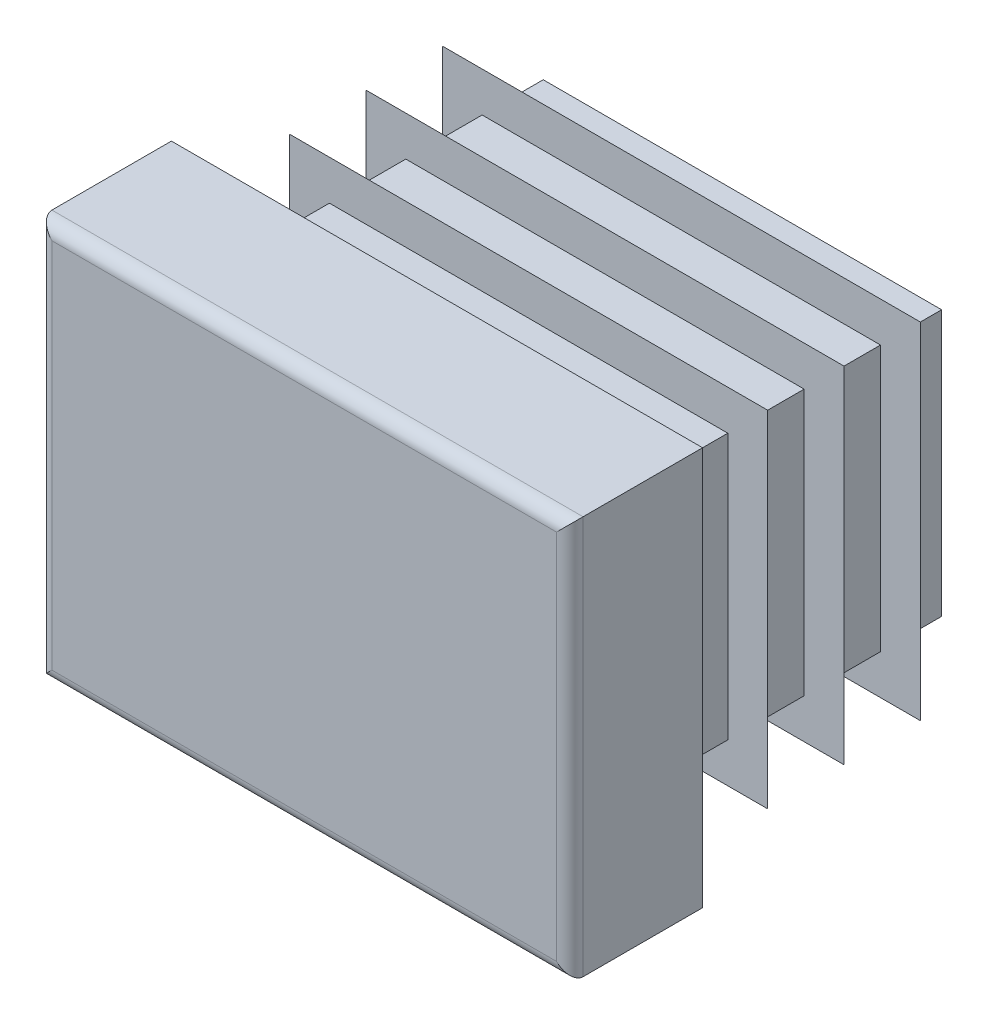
ISO-10303-21;
HEADER;
FILE_DESCRIPTION(('STEP AP214'),'2;1');
FILE_NAME('part.step','',(''),(''),'','','');
FILE_SCHEMA(('AUTOMOTIVE_DESIGN { 1 0 10303 214 1 1 1 1 }'));
ENDSEC;
DATA;
#1=APPLICATION_CONTEXT('core data for automotive mechanical design processes');
#2=APPLICATION_PROTOCOL_DEFINITION('international standard','automotive_design',2000,#1);
#3=PRODUCT_CONTEXT('',#1,'mechanical');
#4=PRODUCT('Part','Part','',(#3));
#5=PRODUCT_RELATED_PRODUCT_CATEGORY('part','',(#4));
#6=PRODUCT_DEFINITION_FORMATION('','',#4);
#7=PRODUCT_DEFINITION_CONTEXT('part definition',#1,'design');
#8=PRODUCT_DEFINITION('design','',#6,#7);
#9=PRODUCT_DEFINITION_SHAPE('','',#8);
#10=(LENGTH_UNIT() NAMED_UNIT(*) SI_UNIT(.MILLI.,.METRE.));
#11=(NAMED_UNIT(*) PLANE_ANGLE_UNIT() SI_UNIT($,.RADIAN.));
#12=(NAMED_UNIT(*) SI_UNIT($,.STERADIAN.) SOLID_ANGLE_UNIT());
#13=UNCERTAINTY_MEASURE_WITH_UNIT(LENGTH_MEASURE(1.E-05),#10,'distance_accuracy_value','');
#14=(GEOMETRIC_REPRESENTATION_CONTEXT(3) GLOBAL_UNCERTAINTY_ASSIGNED_CONTEXT((#13)) GLOBAL_UNIT_ASSIGNED_CONTEXT((#10,
#11,#12)) REPRESENTATION_CONTEXT('',''));
#15=CARTESIAN_POINT('',(0.,0.,0.));
#16=DIRECTION('',(0.,0.,1.));
#17=DIRECTION('',(1.,0.,0.));
#18=AXIS2_PLACEMENT_3D('',#15,#16,#17);
#19=CARTESIAN_POINT('',(9.5,-7.5,5.));
#20=DIRECTION('',(0.,0.,-1.));
#21=DIRECTION('',(0.,1.,0.));
#22=AXIS2_PLACEMENT_3D('',#19,#20,#21);
#23=PLANE('',#22);
#24=DIRECTION('',(0.,1.,0.));
#25=VECTOR('',#24,1.);
#26=CARTESIAN_POINT('',(-9.5,-7.5,5.));
#27=LINE('',#26,#25);
#28=CARTESIAN_POINT('',(-9.5,-7.,5.));
#29=VERTEX_POINT('',#28);
#30=CARTESIAN_POINT('',(-9.5,7.,5.));
#31=VERTEX_POINT('',#30);
#32=EDGE_CURVE('E310',#29,#31,#27,.T.);
#33=ORIENTED_EDGE('',*,*,#32,.F.);
#34=DIRECTION('',(-1.,0.,0.));
#35=VECTOR('',#34,1.);
#36=CARTESIAN_POINT('',(10.,-7.,5.));
#37=LINE('',#36,#35);
#38=CARTESIAN_POINT('',(9.5,-7.,5.));
#39=VERTEX_POINT('',#38);
#40=EDGE_CURVE('E482',#39,#29,#37,.T.);
#41=ORIENTED_EDGE('',*,*,#40,.F.);
#42=DIRECTION('',(0.,1.,0.));
#43=VECTOR('',#42,1.);
#44=CARTESIAN_POINT('',(9.5,-7.5,5.));
#45=LINE('',#44,#43);
#46=CARTESIAN_POINT('',(9.5,7.,5.));
#47=VERTEX_POINT('',#46);
#48=EDGE_CURVE('E305',#39,#47,#45,.T.);
#49=ORIENTED_EDGE('',*,*,#48,.T.);
#50=DIRECTION('',(-1.,0.,0.));
#51=VECTOR('',#50,1.);
#52=CARTESIAN_POINT('',(10.,7.,5.));
#53=LINE('',#52,#51);
#54=EDGE_CURVE('E630',#47,#31,#53,.T.);
#55=ORIENTED_EDGE('',*,*,#54,.T.);
#56=EDGE_LOOP('',(#33,#41,#49,#55));
#57=FACE_BOUND('',#56,.T.);
#58=ADVANCED_FACE('F14',(#57),#23,.F.);
#59=CARTESIAN_POINT('',(-9.5,-7.5,4.5));
#60=DIRECTION('',(0.,1.,0.));
#61=DIRECTION('',(-1.,0.,0.));
#62=AXIS2_PLACEMENT_3D('',#59,#60,#61);
#63=CYLINDRICAL_SURFACE('',#62,0.5);
#64=DIRECTION('',(0.,1.,0.));
#65=VECTOR('',#64,1.);
#66=CARTESIAN_POINT('',(-10.,-7.5,4.5));
#67=LINE('',#66,#65);
#68=CARTESIAN_POINT('',(-10.,-7.5,4.5));
#69=VERTEX_POINT('',#68);
#70=CARTESIAN_POINT('',(-10.,7.5,4.5));
#71=VERTEX_POINT('',#70);
#72=EDGE_CURVE('E402',#69,#71,#67,.T.);
#73=ORIENTED_EDGE('',*,*,#72,.F.);
#74=CARTESIAN_POINT('',(-9.5,-7.,4.5));
#75=DIRECTION('',(-0.707106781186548,0.707106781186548,0.));
#76=DIRECTION('',(0.707106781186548,0.707106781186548,0.));
#77=AXIS2_PLACEMENT_3D('',#74,#75,#76);
#78=ELLIPSE('',#77,0.707106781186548,0.5);
#79=EDGE_CURVE('E59',#69,#29,#78,.T.);
#80=ORIENTED_EDGE('',*,*,#79,.T.);
#81=ORIENTED_EDGE('',*,*,#32,.T.);
#82=CARTESIAN_POINT('',(-9.5,7.,4.5));
#83=DIRECTION('',(0.707106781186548,0.707106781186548,0.));
#84=DIRECTION('',(-0.707106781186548,0.707106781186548,0.));
#85=AXIS2_PLACEMENT_3D('',#82,#83,#84);
#86=ELLIPSE('',#85,0.707106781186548,0.5);
#87=EDGE_CURVE('E306',#31,#71,#86,.F.);
#88=ORIENTED_EDGE('',*,*,#87,.T.);
#89=EDGE_LOOP('',(#73,#80,#81,#88));
#90=FACE_BOUND('',#89,.T.);
#91=ADVANCED_FACE('F16',(#90),#63,.T.);
#92=CARTESIAN_POINT('',(-10.,-7.5,4.5));
#93=DIRECTION('',(1.,0.,0.));
#94=DIRECTION('',(0.,1.,0.));
#95=AXIS2_PLACEMENT_3D('',#92,#93,#94);
#96=PLANE('',#95);
#97=DIRECTION('',(0.,0.,-1.));
#98=VECTOR('',#97,1.);
#99=CARTESIAN_POINT('',(-10.,7.5,4.5));
#100=LINE('',#99,#98);
#101=CARTESIAN_POINT('',(-10.,7.5,0.));
#102=VERTEX_POINT('',#101);
#103=EDGE_CURVE('E615',#71,#102,#100,.T.);
#104=ORIENTED_EDGE('',*,*,#103,.T.);
#105=DIRECTION('',(0.,1.,0.));
#106=VECTOR('',#105,1.);
#107=CARTESIAN_POINT('',(-10.,-7.5,0.));
#108=LINE('',#107,#106);
#109=CARTESIAN_POINT('',(-10.,-7.5,0.));
#110=VERTEX_POINT('',#109);
#111=EDGE_CURVE('E400',#110,#102,#108,.T.);
#112=ORIENTED_EDGE('',*,*,#111,.F.);
#113=DIRECTION('',(0.,0.,-1.));
#114=VECTOR('',#113,1.);
#115=CARTESIAN_POINT('',(-10.,-7.5,4.5));
#116=LINE('',#115,#114);
#117=EDGE_CURVE('E616',#69,#110,#116,.T.);
#118=ORIENTED_EDGE('',*,*,#117,.F.);
#119=ORIENTED_EDGE('',*,*,#72,.T.);
#120=EDGE_LOOP('',(#104,#112,#118,#119));
#121=FACE_BOUND('',#120,.T.);
#122=ADVANCED_FACE('F697',(#121),#96,.F.);
#123=CARTESIAN_POINT('',(-7.5,-7.5,0.));
#124=DIRECTION('',(1.,0.,0.));
#125=DIRECTION('',(0.,1.,0.));
#126=AXIS2_PLACEMENT_3D('',#123,#124,#125);
#127=PLANE('',#126);
#128=DIRECTION('',(0.,1.,0.));
#129=VECTOR('',#128,1.);
#130=CARTESIAN_POINT('',(-7.5,-7.5,0.));
#131=LINE('',#130,#129);
#132=CARTESIAN_POINT('',(-7.5,-5.,0.));
#133=VERTEX_POINT('',#132);
#134=CARTESIAN_POINT('',(-7.5,5.,0.));
#135=VERTEX_POINT('',#134);
#136=EDGE_CURVE('E397',#133,#135,#131,.T.);
#137=ORIENTED_EDGE('',*,*,#136,.T.);
#138=DIRECTION('',(0.,0.,-1.));
#139=VECTOR('',#138,1.);
#140=CARTESIAN_POINT('',(-7.5,5.,0.));
#141=LINE('',#140,#139);
#142=CARTESIAN_POINT('',(-7.5,5.,-0.575));
#143=VERTEX_POINT('',#142);
#144=EDGE_CURVE('E495',#135,#143,#141,.T.);
#145=ORIENTED_EDGE('',*,*,#144,.T.);
#146=DIRECTION('',(0.,1.,0.));
#147=VECTOR('',#146,1.);
#148=CARTESIAN_POINT('',(-7.5,-7.5,-0.575));
#149=LINE('',#148,#147);
#150=CARTESIAN_POINT('',(-7.5,-5.,-0.575));
#151=VERTEX_POINT('',#150);
#152=EDGE_CURVE('E394',#151,#143,#149,.T.);
#153=ORIENTED_EDGE('',*,*,#152,.F.);
#154=DIRECTION('',(0.,0.,1.));
#155=VECTOR('',#154,1.);
#156=CARTESIAN_POINT('',(-7.5,-5.,0.));
#157=LINE('',#156,#155);
#158=EDGE_CURVE('E489',#151,#133,#157,.T.);
#159=ORIENTED_EDGE('',*,*,#158,.T.);
#160=EDGE_LOOP('',(#137,#145,#153,#159));
#161=FACE_BOUND('',#160,.T.);
#162=ADVANCED_FACE('F787',(#161),#127,.F.);
#163=CARTESIAN_POINT('',(-9.,-7.5,-0.575));
#164=DIRECTION('',(0.342020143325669,0.,0.939692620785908));
#165=DIRECTION('',(-0.939692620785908,0.,0.342020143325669));
#166=AXIS2_PLACEMENT_3D('',#163,#164,#165);
#167=PLANE('',#166);
#168=DIRECTION('',(0.,1.,0.));
#169=VECTOR('',#168,1.);
#170=CARTESIAN_POINT('',(-9.,-7.5,-0.575));
#171=LINE('',#170,#169);
#172=CARTESIAN_POINT('',(-9.,-6.5,-0.575));
#173=VERTEX_POINT('',#172);
#174=CARTESIAN_POINT('',(-9.,6.5,-0.575));
#175=VERTEX_POINT('',#174);
#176=EDGE_CURVE('E392',#173,#175,#171,.T.);
#177=ORIENTED_EDGE('',*,*,#176,.T.);
#178=DIRECTION('',(0.844349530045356,-0.438895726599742,-0.307318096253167));
#179=VECTOR('',#178,1.);
#180=CARTESIAN_POINT('',(-3.8118603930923,3.80318757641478,-2.46332838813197));
#181=LINE('',#180,#179);
#182=CARTESIAN_POINT('',(-7.5,5.72029495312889,-1.1209553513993));
#183=VERTEX_POINT('',#182);
#184=EDGE_CURVE('E519',#175,#183,#181,.T.);
#185=ORIENTED_EDGE('',*,*,#184,.T.);
#186=DIRECTION('',(0.,1.,0.));
#187=VECTOR('',#186,1.);
#188=CARTESIAN_POINT('',(-7.5,-7.5,-1.12095535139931));
#189=LINE('',#188,#187);
#190=CARTESIAN_POINT('',(-7.5,-5.72029495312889,-1.12095535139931));
#191=VERTEX_POINT('',#190);
#192=EDGE_CURVE('E389',#191,#183,#189,.T.);
#193=ORIENTED_EDGE('',*,*,#192,.F.);
#194=DIRECTION('',(-0.844349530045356,-0.438895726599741,0.307318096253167));
#195=VECTOR('',#194,1.);
#196=CARTESIAN_POINT('',(-9.37058140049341,-6.69262945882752,-0.440119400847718));
#197=LINE('',#196,#195);
#198=EDGE_CURVE('E507',#191,#173,#197,.T.);
#199=ORIENTED_EDGE('',*,*,#198,.T.);
#200=EDGE_LOOP('',(#177,#185,#193,#199));
#201=FACE_BOUND('',#200,.T.);
#202=ADVANCED_FACE('F783',(#201),#167,.F.);
#203=CARTESIAN_POINT('',(-7.5,-7.5,-1.12095535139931));
#204=DIRECTION('',(1.,0.,0.));
#205=DIRECTION('',(0.,1.,0.));
#206=AXIS2_PLACEMENT_3D('',#203,#204,#205);
#207=PLANE('',#206);
#208=ORIENTED_EDGE('',*,*,#192,.T.);
#209=DIRECTION('',(0.,-0.819152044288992,-0.573576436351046));
#210=VECTOR('',#209,1.);
#211=CARTESIAN_POINT('',(-7.5,-3.15065611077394,-7.33246215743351));
#212=LINE('',#211,#210);
#213=CARTESIAN_POINT('',(-7.5,5.,-1.62531130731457));
#214=VERTEX_POINT('',#213);
#215=EDGE_CURVE('E516',#183,#214,#212,.T.);
#216=ORIENTED_EDGE('',*,*,#215,.T.);
#217=DIRECTION('',(0.,0.,-1.));
#218=VECTOR('',#217,1.);
#219=CARTESIAN_POINT('',(-7.5,5.,-1.12095535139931));
#220=LINE('',#219,#218);
#221=CARTESIAN_POINT('',(-7.5,5.,-3.45));
#222=VERTEX_POINT('',#221);
#223=EDGE_CURVE('E525',#214,#222,#220,.T.);
#224=ORIENTED_EDGE('',*,*,#223,.T.);
#225=DIRECTION('',(0.,1.,0.));
#226=VECTOR('',#225,1.);
#227=CARTESIAN_POINT('',(-7.5,-7.5,-3.45));
#228=LINE('',#227,#226);
#229=CARTESIAN_POINT('',(-7.5,-5.,-3.45));
#230=VERTEX_POINT('',#229);
#231=EDGE_CURVE('E386',#230,#222,#228,.T.);
#232=ORIENTED_EDGE('',*,*,#231,.F.);
#233=DIRECTION('',(0.,0.,1.));
#234=VECTOR('',#233,1.);
#235=CARTESIAN_POINT('',(-7.5,-5.,-1.12095535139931));
#236=LINE('',#235,#234);
#237=CARTESIAN_POINT('',(-7.5,-5.,-1.62531130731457));
#238=VERTEX_POINT('',#237);
#239=EDGE_CURVE('E522',#230,#238,#236,.T.);
#240=ORIENTED_EDGE('',*,*,#239,.T.);
#241=DIRECTION('',(0.,-0.819152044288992,0.573576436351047));
#242=VECTOR('',#241,1.);
#243=CARTESIAN_POINT('',(-7.5,-6.91449496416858,-0.284767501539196));
#244=LINE('',#243,#242);
#245=EDGE_CURVE('E504',#238,#191,#244,.T.);
#246=ORIENTED_EDGE('',*,*,#245,.T.);
#247=EDGE_LOOP('',(#208,#216,#224,#232,#240,#246));
#248=FACE_BOUND('',#247,.T.);
#249=ADVANCED_FACE('F779',(#248),#207,.F.);
#250=CARTESIAN_POINT('',(-9.,-7.5,-3.45));
#251=DIRECTION('',(0.342020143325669,0.,0.939692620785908));
#252=DIRECTION('',(-0.939692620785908,0.,0.342020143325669));
#253=AXIS2_PLACEMENT_3D('',#250,#251,#252);
#254=PLANE('',#253);
#255=DIRECTION('',(0.,1.,0.));
#256=VECTOR('',#255,1.);
#257=CARTESIAN_POINT('',(-9.,-7.5,-3.45));
#258=LINE('',#257,#256);
#259=CARTESIAN_POINT('',(-9.,-6.5,-3.45));
#260=VERTEX_POINT('',#259);
#261=CARTESIAN_POINT('',(-9.,6.5,-3.45));
#262=VERTEX_POINT('',#261);
#263=EDGE_CURVE('E384',#260,#262,#258,.T.);
#264=ORIENTED_EDGE('',*,*,#263,.T.);
#265=DIRECTION('',(0.844349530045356,-0.438895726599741,-0.307318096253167));
#266=VECTOR('',#265,1.);
#267=CARTESIAN_POINT('',(-3.8118603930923,3.80318757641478,-5.33832838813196));
#268=LINE('',#267,#266);
#269=CARTESIAN_POINT('',(-7.5,5.7202949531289,-3.99595535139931));
#270=VERTEX_POINT('',#269);
#271=EDGE_CURVE('E549',#262,#270,#268,.T.);
#272=ORIENTED_EDGE('',*,*,#271,.T.);
#273=DIRECTION('',(0.,1.,0.));
#274=VECTOR('',#273,1.);
#275=CARTESIAN_POINT('',(-7.5,-7.5,-3.99595535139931));
#276=LINE('',#275,#274);
#277=CARTESIAN_POINT('',(-7.5,-5.72029495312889,-3.99595535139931));
#278=VERTEX_POINT('',#277);
#279=EDGE_CURVE('E381',#278,#270,#276,.T.);
#280=ORIENTED_EDGE('',*,*,#279,.F.);
#281=DIRECTION('',(-0.844349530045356,-0.438895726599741,0.307318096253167));
#282=VECTOR('',#281,1.);
#283=CARTESIAN_POINT('',(-9.37058140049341,-6.69262945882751,-3.31511940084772));
#284=LINE('',#283,#282);
#285=EDGE_CURVE('E537',#278,#260,#284,.T.);
#286=ORIENTED_EDGE('',*,*,#285,.T.);
#287=EDGE_LOOP('',(#264,#272,#280,#286));
#288=FACE_BOUND('',#287,.T.);
#289=ADVANCED_FACE('F775',(#288),#254,.F.);
#290=CARTESIAN_POINT('',(-7.5,-7.5,-3.99595535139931));
#291=DIRECTION('',(1.,0.,0.));
#292=DIRECTION('',(0.,1.,0.));
#293=AXIS2_PLACEMENT_3D('',#290,#291,#292);
#294=PLANE('',#293);
#295=ORIENTED_EDGE('',*,*,#279,.T.);
#296=DIRECTION('',(0.,-0.819152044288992,-0.573576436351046));
#297=VECTOR('',#296,1.);
#298=CARTESIAN_POINT('',(-7.5,-3.15065611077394,-10.2074621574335));
#299=LINE('',#298,#297);
#300=CARTESIAN_POINT('',(-7.5,5.,-4.50031130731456));
#301=VERTEX_POINT('',#300);
#302=EDGE_CURVE('E546',#270,#301,#299,.T.);
#303=ORIENTED_EDGE('',*,*,#302,.T.);
#304=DIRECTION('',(0.,0.,-1.));
#305=VECTOR('',#304,1.);
#306=CARTESIAN_POINT('',(-7.5,5.,-3.99595535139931));
#307=LINE('',#306,#305);
#308=CARTESIAN_POINT('',(-7.5,5.,-6.325));
#309=VERTEX_POINT('',#308);
#310=EDGE_CURVE('E555',#301,#309,#307,.T.);
#311=ORIENTED_EDGE('',*,*,#310,.T.);
#312=DIRECTION('',(0.,1.,0.));
#313=VECTOR('',#312,1.);
#314=CARTESIAN_POINT('',(-7.5,-7.5,-6.325));
#315=LINE('',#314,#313);
#316=CARTESIAN_POINT('',(-7.5,-5.,-6.325));
#317=VERTEX_POINT('',#316);
#318=EDGE_CURVE('E378',#317,#309,#315,.T.);
#319=ORIENTED_EDGE('',*,*,#318,.F.);
#320=DIRECTION('',(0.,0.,1.));
#321=VECTOR('',#320,1.);
#322=CARTESIAN_POINT('',(-7.5,-5.,-3.99595535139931));
#323=LINE('',#322,#321);
#324=CARTESIAN_POINT('',(-7.5,-5.,-4.50031130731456));
#325=VERTEX_POINT('',#324);
#326=EDGE_CURVE('E552',#317,#325,#323,.T.);
#327=ORIENTED_EDGE('',*,*,#326,.T.);
#328=DIRECTION('',(0.,-0.819152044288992,0.573576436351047));
#329=VECTOR('',#328,1.);
#330=CARTESIAN_POINT('',(-7.5,-6.91449496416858,-3.1597675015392));
#331=LINE('',#330,#329);
#332=EDGE_CURVE('E534',#325,#278,#331,.T.);
#333=ORIENTED_EDGE('',*,*,#332,.T.);
#334=EDGE_LOOP('',(#295,#303,#311,#319,#327,#333));
#335=FACE_BOUND('',#334,.T.);
#336=ADVANCED_FACE('F771',(#335),#294,.F.);
#337=CARTESIAN_POINT('',(-9.,-7.5,-6.325));
#338=DIRECTION('',(0.34202014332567,0.,0.939692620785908));
#339=DIRECTION('',(-0.939692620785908,0.,0.34202014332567));
#340=AXIS2_PLACEMENT_3D('',#337,#338,#339);
#341=PLANE('',#340);
#342=DIRECTION('',(0.,1.,0.));
#343=VECTOR('',#342,1.);
#344=CARTESIAN_POINT('',(-9.,-7.5,-6.325));
#345=LINE('',#344,#343);
#346=CARTESIAN_POINT('',(-9.,-6.5,-6.325));
#347=VERTEX_POINT('',#346);
#348=CARTESIAN_POINT('',(-9.,6.5,-6.325));
#349=VERTEX_POINT('',#348);
#350=EDGE_CURVE('E376',#347,#349,#345,.T.);
#351=ORIENTED_EDGE('',*,*,#350,.T.);
#352=DIRECTION('',(0.844349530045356,-0.438895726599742,-0.307318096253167));
#353=VECTOR('',#352,1.);
#354=CARTESIAN_POINT('',(-3.8118603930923,3.80318757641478,-8.21332838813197));
#355=LINE('',#354,#353);
#356=CARTESIAN_POINT('',(-7.5,5.72029495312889,-6.87095535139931));
#357=VERTEX_POINT('',#356);
#358=EDGE_CURVE('E579',#349,#357,#355,.T.);
#359=ORIENTED_EDGE('',*,*,#358,.T.);
#360=DIRECTION('',(0.,1.,0.));
#361=VECTOR('',#360,1.);
#362=CARTESIAN_POINT('',(-7.5,-7.5,-6.87095535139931));
#363=LINE('',#362,#361);
#364=CARTESIAN_POINT('',(-7.5,-5.72029495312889,-6.87095535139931));
#365=VERTEX_POINT('',#364);
#366=EDGE_CURVE('E373',#365,#357,#363,.T.);
#367=ORIENTED_EDGE('',*,*,#366,.F.);
#368=DIRECTION('',(-0.844349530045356,-0.438895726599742,0.307318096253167));
#369=VECTOR('',#368,1.);
#370=CARTESIAN_POINT('',(-9.37058140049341,-6.69262945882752,-6.19011940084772));
#371=LINE('',#370,#369);
#372=EDGE_CURVE('E567',#365,#347,#371,.T.);
#373=ORIENTED_EDGE('',*,*,#372,.T.);
#374=EDGE_LOOP('',(#351,#359,#367,#373));
#375=FACE_BOUND('',#374,.T.);
#376=ADVANCED_FACE('F767',(#375),#341,.F.);
#377=CARTESIAN_POINT('',(-7.5,-7.5,-6.87095535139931));
#378=DIRECTION('',(1.,0.,0.));
#379=DIRECTION('',(0.,1.,0.));
#380=AXIS2_PLACEMENT_3D('',#377,#378,#379);
#381=PLANE('',#380);
#382=ORIENTED_EDGE('',*,*,#366,.T.);
#383=DIRECTION('',(0.,-0.819152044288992,-0.573576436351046));
#384=VECTOR('',#383,1.);
#385=CARTESIAN_POINT('',(-7.5,-3.15065611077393,-13.0824621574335));
#386=LINE('',#385,#384);
#387=CARTESIAN_POINT('',(-7.5,5.,-7.37531130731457));
#388=VERTEX_POINT('',#387);
#389=EDGE_CURVE('E576',#357,#388,#386,.T.);
#390=ORIENTED_EDGE('',*,*,#389,.T.);
#391=DIRECTION('',(0.,0.,-1.));
#392=VECTOR('',#391,1.);
#393=CARTESIAN_POINT('',(-7.5,5.,-6.87095535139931));
#394=LINE('',#393,#392);
#395=CARTESIAN_POINT('',(-7.5,5.,-9.2));
#396=VERTEX_POINT('',#395);
#397=EDGE_CURVE('E585',#388,#396,#394,.T.);
#398=ORIENTED_EDGE('',*,*,#397,.T.);
#399=DIRECTION('',(0.,1.,0.));
#400=VECTOR('',#399,1.);
#401=CARTESIAN_POINT('',(-7.5,-7.5,-9.2));
#402=LINE('',#401,#400);
#403=CARTESIAN_POINT('',(-7.5,-5.,-9.2));
#404=VERTEX_POINT('',#403);
#405=EDGE_CURVE('E370',#404,#396,#402,.T.);
#406=ORIENTED_EDGE('',*,*,#405,.F.);
#407=DIRECTION('',(0.,0.,1.));
#408=VECTOR('',#407,1.);
#409=CARTESIAN_POINT('',(-7.5,-5.,-6.87095535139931));
#410=LINE('',#409,#408);
#411=CARTESIAN_POINT('',(-7.5,-5.,-7.37531130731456));
#412=VERTEX_POINT('',#411);
#413=EDGE_CURVE('E582',#404,#412,#410,.T.);
#414=ORIENTED_EDGE('',*,*,#413,.T.);
#415=DIRECTION('',(0.,-0.819152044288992,0.573576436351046));
#416=VECTOR('',#415,1.);
#417=CARTESIAN_POINT('',(-7.5,-6.91449496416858,-6.0347675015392));
#418=LINE('',#417,#416);
#419=EDGE_CURVE('E564',#412,#365,#418,.T.);
#420=ORIENTED_EDGE('',*,*,#419,.T.);
#421=EDGE_LOOP('',(#382,#390,#398,#406,#414,#420));
#422=FACE_BOUND('',#421,.T.);
#423=ADVANCED_FACE('F764',(#422),#381,.F.);
#424=CARTESIAN_POINT('',(-9.,-7.5,-9.2));
#425=DIRECTION('',(0.342020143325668,0.,0.939692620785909));
#426=DIRECTION('',(-0.939692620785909,0.,0.342020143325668));
#427=AXIS2_PLACEMENT_3D('',#424,#425,#426);
#428=PLANE('',#427);
#429=DIRECTION('',(0.,1.,0.));
#430=VECTOR('',#429,1.);
#431=CARTESIAN_POINT('',(-9.,-7.5,-9.2));
#432=LINE('',#431,#430);
#433=CARTESIAN_POINT('',(-9.,-6.5,-9.2));
#434=VERTEX_POINT('',#433);
#435=CARTESIAN_POINT('',(-9.,6.5,-9.2));
#436=VERTEX_POINT('',#435);
#437=EDGE_CURVE('E368',#434,#436,#432,.T.);
#438=ORIENTED_EDGE('',*,*,#437,.T.);
#439=DIRECTION('',(0.844349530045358,-0.43889572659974,-0.307318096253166));
#440=VECTOR('',#439,1.);
#441=CARTESIAN_POINT('',(-3.81186039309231,3.8031875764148,-11.0883283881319));
#442=LINE('',#441,#440);
#443=CARTESIAN_POINT('',(-7.5,5.7202949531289,-9.7459553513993));
#444=VERTEX_POINT('',#443);
#445=EDGE_CURVE('E607',#436,#444,#442,.T.);
#446=ORIENTED_EDGE('',*,*,#445,.T.);
#447=DIRECTION('',(0.,1.,0.));
#448=VECTOR('',#447,1.);
#449=CARTESIAN_POINT('',(-7.5,-7.5,-9.7459553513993));
#450=LINE('',#449,#448);
#451=CARTESIAN_POINT('',(-7.5,-5.72029495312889,-9.7459553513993));
#452=VERTEX_POINT('',#451);
#453=EDGE_CURVE('E365',#452,#444,#450,.T.);
#454=ORIENTED_EDGE('',*,*,#453,.F.);
#455=DIRECTION('',(-0.844349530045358,-0.43889572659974,0.307318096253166));
#456=VECTOR('',#455,1.);
#457=CARTESIAN_POINT('',(-9.37058140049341,-6.69262945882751,-9.06511940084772));
#458=LINE('',#457,#456);
#459=EDGE_CURVE('E595',#452,#434,#458,.T.);
#460=ORIENTED_EDGE('',*,*,#459,.T.);
#461=EDGE_LOOP('',(#438,#446,#454,#460));
#462=FACE_BOUND('',#461,.T.);
#463=ADVANCED_FACE('F675',(#462),#428,.F.);
#464=CARTESIAN_POINT('',(-7.5,-7.5,-9.7459553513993));
#465=DIRECTION('',(1.,0.,0.));
#466=DIRECTION('',(0.,1.,0.));
#467=AXIS2_PLACEMENT_3D('',#464,#465,#466);
#468=PLANE('',#467);
#469=ORIENTED_EDGE('',*,*,#453,.T.);
#470=DIRECTION('',(0.,-0.819152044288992,-0.573576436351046));
#471=VECTOR('',#470,1.);
#472=CARTESIAN_POINT('',(-7.5,-3.15065611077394,-15.9574621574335));
#473=LINE('',#472,#471);
#474=CARTESIAN_POINT('',(-7.5,5.,-10.2503113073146));
#475=VERTEX_POINT('',#474);
#476=EDGE_CURVE('E604',#444,#475,#473,.T.);
#477=ORIENTED_EDGE('',*,*,#476,.T.);
#478=DIRECTION('',(0.,0.,-1.));
#479=VECTOR('',#478,1.);
#480=CARTESIAN_POINT('',(-7.5,5.,-9.7459553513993));
#481=LINE('',#480,#479);
#482=CARTESIAN_POINT('',(-7.5,5.,-11.5));
#483=VERTEX_POINT('',#482);
#484=EDGE_CURVE('E613',#475,#483,#481,.T.);
#485=ORIENTED_EDGE('',*,*,#484,.T.);
#486=DIRECTION('',(0.,1.,0.));
#487=VECTOR('',#486,1.);
#488=CARTESIAN_POINT('',(-7.5,-7.5,-11.5));
#489=LINE('',#488,#487);
#490=CARTESIAN_POINT('',(-7.5,-5.,-11.5));
#491=VERTEX_POINT('',#490);
#492=EDGE_CURVE('E362',#491,#483,#489,.T.);
#493=ORIENTED_EDGE('',*,*,#492,.F.);
#494=DIRECTION('',(0.,0.,1.));
#495=VECTOR('',#494,1.);
#496=CARTESIAN_POINT('',(-7.5,-5.,-9.7459553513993));
#497=LINE('',#496,#495);
#498=CARTESIAN_POINT('',(-7.5,-5.,-10.2503113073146));
#499=VERTEX_POINT('',#498);
#500=EDGE_CURVE('E610',#491,#499,#497,.T.);
#501=ORIENTED_EDGE('',*,*,#500,.T.);
#502=DIRECTION('',(0.,-0.819152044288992,0.573576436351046));
#503=VECTOR('',#502,1.);
#504=CARTESIAN_POINT('',(-7.5,-6.91449496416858,-8.9097675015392));
#505=LINE('',#504,#503);
#506=EDGE_CURVE('E592',#499,#452,#505,.T.);
#507=ORIENTED_EDGE('',*,*,#506,.T.);
#508=EDGE_LOOP('',(#469,#477,#485,#493,#501,#507));
#509=FACE_BOUND('',#508,.T.);
#510=ADVANCED_FACE('F677',(#509),#468,.F.);
#511=CARTESIAN_POINT('',(-7.5,-7.5,-11.5));
#512=DIRECTION('',(0.,0.,1.));
#513=DIRECTION('',(0.,-1.,0.));
#514=AXIS2_PLACEMENT_3D('',#511,#512,#513);
#515=PLANE('',#514);
#516=ORIENTED_EDGE('',*,*,#492,.T.);
#517=DIRECTION('',(-1.,0.,0.));
#518=VECTOR('',#517,1.);
#519=CARTESIAN_POINT('',(10.,5.,-11.5));
#520=LINE('',#519,#518);
#521=CARTESIAN_POINT('',(7.5,5.,-11.5));
#522=VERTEX_POINT('',#521);
#523=EDGE_CURVE('E438',#522,#483,#520,.T.);
#524=ORIENTED_EDGE('',*,*,#523,.F.);
#525=DIRECTION('',(0.,1.,0.));
#526=VECTOR('',#525,1.);
#527=CARTESIAN_POINT('',(7.5,-7.5,-11.5));
#528=LINE('',#527,#526);
#529=CARTESIAN_POINT('',(7.5,-5.,-11.5));
#530=VERTEX_POINT('',#529);
#531=EDGE_CURVE('E359',#530,#522,#528,.T.);
#532=ORIENTED_EDGE('',*,*,#531,.F.);
#533=DIRECTION('',(-1.,0.,0.));
#534=VECTOR('',#533,1.);
#535=CARTESIAN_POINT('',(10.,-5.,-11.5));
#536=LINE('',#535,#534);
#537=EDGE_CURVE('E436',#530,#491,#536,.T.);
#538=ORIENTED_EDGE('',*,*,#537,.T.);
#539=EDGE_LOOP('',(#516,#524,#532,#538));
#540=FACE_BOUND('',#539,.T.);
#541=ADVANCED_FACE('F435',(#540),#515,.F.);
#542=CARTESIAN_POINT('',(7.5,-7.5,-11.5));
#543=DIRECTION('',(-1.,0.,0.));
#544=DIRECTION('',(0.,-1.,0.));
#545=AXIS2_PLACEMENT_3D('',#542,#543,#544);
#546=PLANE('',#545);
#547=DIRECTION('',(0.,0.,1.));
#548=VECTOR('',#547,1.);
#549=CARTESIAN_POINT('',(7.5,5.,-11.5));
#550=LINE('',#549,#548);
#551=CARTESIAN_POINT('',(7.5,5.,-10.2503113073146));
#552=VERTEX_POINT('',#551);
#553=EDGE_CURVE('E9',#522,#552,#550,.T.);
#554=ORIENTED_EDGE('',*,*,#553,.T.);
#555=DIRECTION('',(0.,0.819152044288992,0.573576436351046));
#556=VECTOR('',#555,1.);
#557=CARTESIAN_POINT('',(7.5,-3.97478751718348,-16.5345251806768));
#558=LINE('',#557,#556);
#559=CARTESIAN_POINT('',(7.5,5.72029495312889,-9.7459553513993));
#560=VERTEX_POINT('',#559);
#561=EDGE_CURVE('E601',#552,#560,#558,.T.);
#562=ORIENTED_EDGE('',*,*,#561,.T.);
#563=DIRECTION('',(0.,1.,0.));
#564=VECTOR('',#563,1.);
#565=CARTESIAN_POINT('',(7.5,-7.5,-9.7459553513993));
#566=LINE('',#565,#564);
#567=CARTESIAN_POINT('',(7.5,-5.7202949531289,-9.7459553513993));
#568=VERTEX_POINT('',#567);
#569=EDGE_CURVE('E356',#568,#560,#566,.T.);
#570=ORIENTED_EDGE('',*,*,#569,.F.);
#571=DIRECTION('',(0.,0.819152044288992,-0.573576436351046));
#572=VECTOR('',#571,1.);
#573=CARTESIAN_POINT('',(7.5,-6.09036355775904,-9.48683052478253));
#574=LINE('',#573,#572);
#575=CARTESIAN_POINT('',(7.5,-5.,-10.2503113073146));
#576=VERTEX_POINT('',#575);
#577=EDGE_CURVE('E428',#568,#576,#574,.T.);
#578=ORIENTED_EDGE('',*,*,#577,.T.);
#579=DIRECTION('',(0.,0.,-1.));
#580=VECTOR('',#579,1.);
#581=CARTESIAN_POINT('',(7.5,-5.,-11.5));
#582=LINE('',#581,#580);
#583=EDGE_CURVE('E23',#576,#530,#582,.T.);
#584=ORIENTED_EDGE('',*,*,#583,.T.);
#585=ORIENTED_EDGE('',*,*,#531,.T.);
#586=EDGE_LOOP('',(#554,#562,#570,#578,#584,#585));
#587=FACE_BOUND('',#586,.T.);
#588=ADVANCED_FACE('F426',(#587),#546,.F.);
#589=CARTESIAN_POINT('',(7.5,-7.5,-9.7459553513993));
#590=DIRECTION('',(-0.342020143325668,0.,0.939692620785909));
#591=DIRECTION('',(-0.939692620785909,0.,-0.342020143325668));
#592=AXIS2_PLACEMENT_3D('',#589,#590,#591);
#593=PLANE('',#592);
#594=ORIENTED_EDGE('',*,*,#569,.T.);
#595=DIRECTION('',(0.844349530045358,0.43889572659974,0.307318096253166));
#596=VECTOR('',#595,1.);
#597=CARTESIAN_POINT('',(2.60080458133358,3.17367669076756,-11.5291166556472));
#598=LINE('',#597,#596);
#599=CARTESIAN_POINT('',(9.,6.5,-9.2));
#600=VERTEX_POINT('',#599);
#601=EDGE_CURVE('E598',#560,#600,#598,.T.);
#602=ORIENTED_EDGE('',*,*,#601,.T.);
#603=DIRECTION('',(0.,1.,0.));
#604=VECTOR('',#603,1.);
#605=CARTESIAN_POINT('',(9.,-7.5,-9.2));
#606=LINE('',#605,#604);
#607=CARTESIAN_POINT('',(9.,-6.5,-9.2));
#608=VERTEX_POINT('',#607);
#609=EDGE_CURVE('E353',#608,#600,#606,.T.);
#610=ORIENTED_EDGE('',*,*,#609,.F.);
#611=DIRECTION('',(-0.844349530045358,0.43889572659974,-0.307318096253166));
#612=VECTOR('',#611,1.);
#613=CARTESIAN_POINT('',(8.15952558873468,-6.06311857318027,-9.50590766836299));
#614=LINE('',#613,#612);
#615=EDGE_CURVE('E588',#608,#568,#614,.T.);
#616=ORIENTED_EDGE('',*,*,#615,.T.);
#617=EDGE_LOOP('',(#594,#602,#610,#616));
#618=FACE_BOUND('',#617,.T.);
#619=ADVANCED_FACE('F752',(#618),#593,.F.);
#620=CARTESIAN_POINT('',(9.,-7.5,-9.2));
#621=DIRECTION('',(0.,0.,-1.));
#622=DIRECTION('',(0.,1.,0.));
#623=AXIS2_PLACEMENT_3D('',#620,#621,#622);
#624=PLANE('',#623);
#625=ORIENTED_EDGE('',*,*,#609,.T.);
#626=DIRECTION('',(-1.,0.,0.));
#627=VECTOR('',#626,1.);
#628=CARTESIAN_POINT('',(10.,6.5,-9.2));
#629=LINE('',#628,#627);
#630=EDGE_CURVE('E444',#600,#436,#629,.T.);
#631=ORIENTED_EDGE('',*,*,#630,.T.);
#632=ORIENTED_EDGE('',*,*,#437,.F.);
#633=DIRECTION('',(-1.,0.,0.));
#634=VECTOR('',#633,1.);
#635=CARTESIAN_POINT('',(10.,-6.5,-9.2));
#636=LINE('',#635,#634);
#637=EDGE_CURVE('E451',#608,#434,#636,.T.);
#638=ORIENTED_EDGE('',*,*,#637,.F.);
#639=EDGE_LOOP('',(#625,#631,#632,#638));
#640=FACE_BOUND('',#639,.T.);
#641=ORIENTED_EDGE('',*,*,#405,.T.);
#642=DIRECTION('',(-1.,0.,0.));
#643=VECTOR('',#642,1.);
#644=CARTESIAN_POINT('',(10.,5.,-9.2));
#645=LINE('',#644,#643);
#646=CARTESIAN_POINT('',(7.5,5.,-9.2));
#647=VERTEX_POINT('',#646);
#648=EDGE_CURVE('E663',#647,#396,#645,.T.);
#649=ORIENTED_EDGE('',*,*,#648,.F.);
#650=DIRECTION('',(0.,1.,0.));
#651=VECTOR('',#650,1.);
#652=CARTESIAN_POINT('',(7.5,-7.5,-9.2));
#653=LINE('',#652,#651);
#654=CARTESIAN_POINT('',(7.5,-5.,-9.2));
#655=VERTEX_POINT('',#654);
#656=EDGE_CURVE('E350',#655,#647,#653,.T.);
#657=ORIENTED_EDGE('',*,*,#656,.F.);
#658=DIRECTION('',(-1.,0.,0.));
#659=VECTOR('',#658,1.);
#660=CARTESIAN_POINT('',(10.,-5.,-9.2));
#661=LINE('',#660,#659);
#662=EDGE_CURVE('E453',#655,#404,#661,.T.);
#663=ORIENTED_EDGE('',*,*,#662,.T.);
#664=EDGE_LOOP('',(#641,#649,#657,#663));
#665=FACE_BOUND('',#664,.T.);
#666=ADVANCED_FACE('F667',(#640,#665),#624,.F.);
#667=CARTESIAN_POINT('',(7.5,-7.5,-9.2));
#668=DIRECTION('',(-1.,0.,0.));
#669=DIRECTION('',(0.,-1.,0.));
#670=AXIS2_PLACEMENT_3D('',#667,#668,#669);
#671=PLANE('',#670);
#672=DIRECTION('',(0.,0.,1.));
#673=VECTOR('',#672,1.);
#674=CARTESIAN_POINT('',(7.5,5.,-9.2));
#675=LINE('',#674,#673);
#676=CARTESIAN_POINT('',(7.5,5.,-7.37531130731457));
#677=VERTEX_POINT('',#676);
#678=EDGE_CURVE('E420',#647,#677,#675,.T.);
#679=ORIENTED_EDGE('',*,*,#678,.T.);
#680=DIRECTION('',(0.,0.819152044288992,0.573576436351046));
#681=VECTOR('',#680,1.);
#682=CARTESIAN_POINT('',(7.5,-4.24494914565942,-13.8486943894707));
#683=LINE('',#682,#681);
#684=CARTESIAN_POINT('',(7.5,5.72029495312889,-6.87095535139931));
#685=VERTEX_POINT('',#684);
#686=EDGE_CURVE('E573',#677,#685,#683,.T.);
#687=ORIENTED_EDGE('',*,*,#686,.T.);
#688=DIRECTION('',(0.,1.,0.));
#689=VECTOR('',#688,1.);
#690=CARTESIAN_POINT('',(7.5,-7.5,-6.87095535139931));
#691=LINE('',#690,#689);
#692=CARTESIAN_POINT('',(7.5,-5.72029495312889,-6.87095535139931));
#693=VERTEX_POINT('',#692);
#694=EDGE_CURVE('E347',#693,#685,#691,.T.);
#695=ORIENTED_EDGE('',*,*,#694,.F.);
#696=DIRECTION('',(0.,0.819152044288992,-0.573576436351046));
#697=VECTOR('',#696,1.);
#698=CARTESIAN_POINT('',(7.5,-5.82020192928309,-6.8009997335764));
#699=LINE('',#698,#697);
#700=CARTESIAN_POINT('',(7.5,-5.,-7.37531130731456));
#701=VERTEX_POINT('',#700);
#702=EDGE_CURVE('E561',#693,#701,#699,.T.);
#703=ORIENTED_EDGE('',*,*,#702,.T.);
#704=DIRECTION('',(0.,0.,-1.));
#705=VECTOR('',#704,1.);
#706=CARTESIAN_POINT('',(7.5,-5.,-9.2));
#707=LINE('',#706,#705);
#708=EDGE_CURVE('E417',#701,#655,#707,.T.);
#709=ORIENTED_EDGE('',*,*,#708,.T.);
#710=ORIENTED_EDGE('',*,*,#656,.T.);
#711=EDGE_LOOP('',(#679,#687,#695,#703,#709,#710));
#712=FACE_BOUND('',#711,.T.);
#713=ADVANCED_FACE('F745',(#712),#671,.F.);
#714=CARTESIAN_POINT('',(7.5,-7.5,-6.87095535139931));
#715=DIRECTION('',(-0.342020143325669,0.,0.939692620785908));
#716=DIRECTION('',(-0.939692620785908,0.,-0.342020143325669));
#717=AXIS2_PLACEMENT_3D('',#714,#715,#716);
#718=PLANE('',#717);
#719=ORIENTED_EDGE('',*,*,#694,.T.);
#720=DIRECTION('',(0.844349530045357,0.438895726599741,0.307318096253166));
#721=VECTOR('',#720,1.);
#722=CARTESIAN_POINT('',(2.60080458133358,3.17367669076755,-8.65411665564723));
#723=LINE('',#722,#721);
#724=CARTESIAN_POINT('',(9.,6.5,-6.325));
#725=VERTEX_POINT('',#724);
#726=EDGE_CURVE('E570',#685,#725,#723,.T.);
#727=ORIENTED_EDGE('',*,*,#726,.T.);
#728=DIRECTION('',(0.,1.,0.));
#729=VECTOR('',#728,1.);
#730=CARTESIAN_POINT('',(9.,-7.5,-6.325));
#731=LINE('',#730,#729);
#732=CARTESIAN_POINT('',(9.,-6.5,-6.325));
#733=VERTEX_POINT('',#732);
#734=EDGE_CURVE('E344',#733,#725,#731,.T.);
#735=ORIENTED_EDGE('',*,*,#734,.F.);
#736=DIRECTION('',(-0.844349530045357,0.438895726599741,-0.307318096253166));
#737=VECTOR('',#736,1.);
#738=CARTESIAN_POINT('',(8.15952558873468,-6.06311857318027,-6.63090766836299));
#739=LINE('',#738,#737);
#740=EDGE_CURVE('E558',#733,#693,#739,.T.);
#741=ORIENTED_EDGE('',*,*,#740,.T.);
#742=EDGE_LOOP('',(#719,#727,#735,#741));
#743=FACE_BOUND('',#742,.T.);
#744=ADVANCED_FACE('F741',(#743),#718,.F.);
#745=CARTESIAN_POINT('',(9.,-7.5,-6.325));
#746=DIRECTION('',(0.,0.,-1.));
#747=DIRECTION('',(0.,1.,0.));
#748=AXIS2_PLACEMENT_3D('',#745,#746,#747);
#749=PLANE('',#748);
#750=ORIENTED_EDGE('',*,*,#734,.T.);
#751=DIRECTION('',(-1.,0.,0.));
#752=VECTOR('',#751,1.);
#753=CARTESIAN_POINT('',(10.,6.5,-6.325));
#754=LINE('',#753,#752);
#755=EDGE_CURVE('E657',#725,#349,#754,.T.);
#756=ORIENTED_EDGE('',*,*,#755,.T.);
#757=ORIENTED_EDGE('',*,*,#350,.F.);
#758=DIRECTION('',(-1.,0.,0.));
#759=VECTOR('',#758,1.);
#760=CARTESIAN_POINT('',(10.,-6.5,-6.325));
#761=LINE('',#760,#759);
#762=EDGE_CURVE('E459',#733,#347,#761,.T.);
#763=ORIENTED_EDGE('',*,*,#762,.F.);
#764=EDGE_LOOP('',(#750,#756,#757,#763));
#765=FACE_BOUND('',#764,.T.);
#766=ORIENTED_EDGE('',*,*,#318,.T.);
#767=DIRECTION('',(-1.,0.,0.));
#768=VECTOR('',#767,1.);
#769=CARTESIAN_POINT('',(10.,5.,-6.325));
#770=LINE('',#769,#768);
#771=CARTESIAN_POINT('',(7.5,5.,-6.325));
#772=VERTEX_POINT('',#771);
#773=EDGE_CURVE('E655',#772,#309,#770,.T.);
#774=ORIENTED_EDGE('',*,*,#773,.F.);
#775=DIRECTION('',(0.,1.,0.));
#776=VECTOR('',#775,1.);
#777=CARTESIAN_POINT('',(7.5,-7.5,-6.325));
#778=LINE('',#777,#776);
#779=CARTESIAN_POINT('',(7.5,-5.,-6.325));
#780=VERTEX_POINT('',#779);
#781=EDGE_CURVE('E341',#780,#772,#778,.T.);
#782=ORIENTED_EDGE('',*,*,#781,.F.);
#783=DIRECTION('',(-1.,0.,0.));
#784=VECTOR('',#783,1.);
#785=CARTESIAN_POINT('',(10.,-5.,-6.325));
#786=LINE('',#785,#784);
#787=EDGE_CURVE('E461',#780,#317,#786,.T.);
#788=ORIENTED_EDGE('',*,*,#787,.T.);
#789=EDGE_LOOP('',(#766,#774,#782,#788));
#790=FACE_BOUND('',#789,.T.);
#791=ADVANCED_FACE('F737',(#765,#790),#749,.F.);
#792=CARTESIAN_POINT('',(7.5,-7.5,-6.325));
#793=DIRECTION('',(-1.,0.,0.));
#794=DIRECTION('',(0.,-1.,0.));
#795=AXIS2_PLACEMENT_3D('',#792,#793,#794);
#796=PLANE('',#795);
#797=DIRECTION('',(0.,0.,1.));
#798=VECTOR('',#797,1.);
#799=CARTESIAN_POINT('',(7.5,5.,-6.325));
#800=LINE('',#799,#798);
#801=CARTESIAN_POINT('',(7.5,5.,-4.50031130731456));
#802=VERTEX_POINT('',#801);
#803=EDGE_CURVE('E414',#772,#802,#800,.T.);
#804=ORIENTED_EDGE('',*,*,#803,.T.);
#805=DIRECTION('',(0.,0.819152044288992,0.573576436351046));
#806=VECTOR('',#805,1.);
#807=CARTESIAN_POINT('',(7.5,-4.24494914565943,-10.9736943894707));
#808=LINE('',#807,#806);
#809=CARTESIAN_POINT('',(7.5,5.72029495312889,-3.99595535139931));
#810=VERTEX_POINT('',#809);
#811=EDGE_CURVE('E543',#802,#810,#808,.T.);
#812=ORIENTED_EDGE('',*,*,#811,.T.);
#813=DIRECTION('',(0.,1.,0.));
#814=VECTOR('',#813,1.);
#815=CARTESIAN_POINT('',(7.5,-7.5,-3.99595535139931));
#816=LINE('',#815,#814);
#817=CARTESIAN_POINT('',(7.5,-5.72029495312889,-3.99595535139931));
#818=VERTEX_POINT('',#817);
#819=EDGE_CURVE('E338',#818,#810,#816,.T.);
#820=ORIENTED_EDGE('',*,*,#819,.F.);
#821=DIRECTION('',(0.,0.819152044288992,-0.573576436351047));
#822=VECTOR('',#821,1.);
#823=CARTESIAN_POINT('',(7.5,-5.82020192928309,-3.9259997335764));
#824=LINE('',#823,#822);
#825=CARTESIAN_POINT('',(7.5,-5.,-4.50031130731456));
#826=VERTEX_POINT('',#825);
#827=EDGE_CURVE('E531',#818,#826,#824,.T.);
#828=ORIENTED_EDGE('',*,*,#827,.T.);
#829=DIRECTION('',(0.,0.,-1.));
#830=VECTOR('',#829,1.);
#831=CARTESIAN_POINT('',(7.5,-5.,-6.325));
#832=LINE('',#831,#830);
#833=EDGE_CURVE('E411',#826,#780,#832,.T.);
#834=ORIENTED_EDGE('',*,*,#833,.T.);
#835=ORIENTED_EDGE('',*,*,#781,.T.);
#836=EDGE_LOOP('',(#804,#812,#820,#828,#834,#835));
#837=FACE_BOUND('',#836,.T.);
#838=ADVANCED_FACE('F733',(#837),#796,.F.);
#839=CARTESIAN_POINT('',(7.5,-7.5,-3.99595535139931));
#840=DIRECTION('',(-0.342020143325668,0.,0.939692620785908));
#841=DIRECTION('',(-0.939692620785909,0.,-0.342020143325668));
#842=AXIS2_PLACEMENT_3D('',#839,#840,#841);
#843=PLANE('',#842);
#844=ORIENTED_EDGE('',*,*,#819,.T.);
#845=DIRECTION('',(0.844349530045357,0.43889572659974,0.307318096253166));
#846=VECTOR('',#845,1.);
#847=CARTESIAN_POINT('',(2.60080458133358,3.17367669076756,-5.77911665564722));
#848=LINE('',#847,#846);
#849=CARTESIAN_POINT('',(9.,6.5,-3.45));
#850=VERTEX_POINT('',#849);
#851=EDGE_CURVE('E540',#810,#850,#848,.T.);
#852=ORIENTED_EDGE('',*,*,#851,.T.);
#853=DIRECTION('',(0.,1.,0.));
#854=VECTOR('',#853,1.);
#855=CARTESIAN_POINT('',(9.,-7.5,-3.45));
#856=LINE('',#855,#854);
#857=CARTESIAN_POINT('',(9.,-6.5,-3.45));
#858=VERTEX_POINT('',#857);
#859=EDGE_CURVE('E335',#858,#850,#856,.T.);
#860=ORIENTED_EDGE('',*,*,#859,.F.);
#861=DIRECTION('',(-0.844349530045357,0.43889572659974,-0.307318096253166));
#862=VECTOR('',#861,1.);
#863=CARTESIAN_POINT('',(8.15952558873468,-6.06311857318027,-3.75590766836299));
#864=LINE('',#863,#862);
#865=EDGE_CURVE('E528',#858,#818,#864,.T.);
#866=ORIENTED_EDGE('',*,*,#865,.T.);
#867=EDGE_LOOP('',(#844,#852,#860,#866));
#868=FACE_BOUND('',#867,.T.);
#869=ADVANCED_FACE('F729',(#868),#843,.F.);
#870=CARTESIAN_POINT('',(9.,-7.5,-3.45));
#871=DIRECTION('',(0.,0.,-1.));
#872=DIRECTION('',(0.,1.,0.));
#873=AXIS2_PLACEMENT_3D('',#870,#871,#872);
#874=PLANE('',#873);
#875=ORIENTED_EDGE('',*,*,#859,.T.);
#876=DIRECTION('',(-1.,0.,0.));
#877=VECTOR('',#876,1.);
#878=CARTESIAN_POINT('',(10.,6.5,-3.45));
#879=LINE('',#878,#877);
#880=EDGE_CURVE('E649',#850,#262,#879,.T.);
#881=ORIENTED_EDGE('',*,*,#880,.T.);
#882=ORIENTED_EDGE('',*,*,#263,.F.);
#883=DIRECTION('',(-1.,0.,0.));
#884=VECTOR('',#883,1.);
#885=CARTESIAN_POINT('',(10.,-6.5,-3.45));
#886=LINE('',#885,#884);
#887=EDGE_CURVE('E467',#858,#260,#886,.T.);
#888=ORIENTED_EDGE('',*,*,#887,.F.);
#889=EDGE_LOOP('',(#875,#881,#882,#888));
#890=FACE_BOUND('',#889,.T.);
#891=ORIENTED_EDGE('',*,*,#231,.T.);
#892=DIRECTION('',(-1.,0.,0.));
#893=VECTOR('',#892,1.);
#894=CARTESIAN_POINT('',(10.,5.,-3.45));
#895=LINE('',#894,#893);
#896=CARTESIAN_POINT('',(7.5,5.,-3.45));
#897=VERTEX_POINT('',#896);
#898=EDGE_CURVE('E647',#897,#222,#895,.T.);
#899=ORIENTED_EDGE('',*,*,#898,.F.);
#900=DIRECTION('',(0.,1.,0.));
#901=VECTOR('',#900,1.);
#902=CARTESIAN_POINT('',(7.5,-7.5,-3.45));
#903=LINE('',#902,#901);
#904=CARTESIAN_POINT('',(7.5,-5.,-3.45));
#905=VERTEX_POINT('',#904);
#906=EDGE_CURVE('E332',#905,#897,#903,.T.);
#907=ORIENTED_EDGE('',*,*,#906,.F.);
#908=DIRECTION('',(-1.,0.,0.));
#909=VECTOR('',#908,1.);
#910=CARTESIAN_POINT('',(10.,-5.,-3.45));
#911=LINE('',#910,#909);
#912=EDGE_CURVE('E469',#905,#230,#911,.T.);
#913=ORIENTED_EDGE('',*,*,#912,.T.);
#914=EDGE_LOOP('',(#891,#899,#907,#913));
#915=FACE_BOUND('',#914,.T.);
#916=ADVANCED_FACE('F725',(#890,#915),#874,.F.);
#917=CARTESIAN_POINT('',(7.5,-7.5,-3.45));
#918=DIRECTION('',(-1.,0.,0.));
#919=DIRECTION('',(0.,-1.,0.));
#920=AXIS2_PLACEMENT_3D('',#917,#918,#919);
#921=PLANE('',#920);
#922=DIRECTION('',(0.,0.,1.));
#923=VECTOR('',#922,1.);
#924=CARTESIAN_POINT('',(7.5,5.,-3.45));
#925=LINE('',#924,#923);
#926=CARTESIAN_POINT('',(7.5,5.,-1.62531130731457));
#927=VERTEX_POINT('',#926);
#928=EDGE_CURVE('E408',#897,#927,#925,.T.);
#929=ORIENTED_EDGE('',*,*,#928,.T.);
#930=DIRECTION('',(0.,0.819152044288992,0.573576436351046));
#931=VECTOR('',#930,1.);
#932=CARTESIAN_POINT('',(7.5,-4.24494914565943,-8.09869438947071));
#933=LINE('',#932,#931);
#934=CARTESIAN_POINT('',(7.5,5.72029495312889,-1.1209553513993));
#935=VERTEX_POINT('',#934);
#936=EDGE_CURVE('E513',#927,#935,#933,.T.);
#937=ORIENTED_EDGE('',*,*,#936,.T.);
#938=DIRECTION('',(0.,1.,0.));
#939=VECTOR('',#938,1.);
#940=CARTESIAN_POINT('',(7.5,-7.5,-1.1209553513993));
#941=LINE('',#940,#939);
#942=CARTESIAN_POINT('',(7.5,-5.7202949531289,-1.1209553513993));
#943=VERTEX_POINT('',#942);
#944=EDGE_CURVE('E329',#943,#935,#941,.T.);
#945=ORIENTED_EDGE('',*,*,#944,.F.);
#946=DIRECTION('',(0.,0.819152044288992,-0.573576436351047));
#947=VECTOR('',#946,1.);
#948=CARTESIAN_POINT('',(7.5,-5.82020192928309,-1.0509997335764));
#949=LINE('',#948,#947);
#950=CARTESIAN_POINT('',(7.5,-5.,-1.62531130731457));
#951=VERTEX_POINT('',#950);
#952=EDGE_CURVE('E501',#943,#951,#949,.T.);
#953=ORIENTED_EDGE('',*,*,#952,.T.);
#954=DIRECTION('',(0.,0.,-1.));
#955=VECTOR('',#954,1.);
#956=CARTESIAN_POINT('',(7.5,-5.,-3.45));
#957=LINE('',#956,#955);
#958=EDGE_CURVE('E405',#951,#905,#957,.T.);
#959=ORIENTED_EDGE('',*,*,#958,.T.);
#960=ORIENTED_EDGE('',*,*,#906,.T.);
#961=EDGE_LOOP('',(#929,#937,#945,#953,#959,#960));
#962=FACE_BOUND('',#961,.T.);
#963=ADVANCED_FACE('F721',(#962),#921,.F.);
#964=CARTESIAN_POINT('',(7.5,-7.5,-1.1209553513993));
#965=DIRECTION('',(-0.342020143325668,0.,0.939692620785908));
#966=DIRECTION('',(-0.939692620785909,0.,-0.342020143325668));
#967=AXIS2_PLACEMENT_3D('',#964,#965,#966);
#968=PLANE('',#967);
#969=ORIENTED_EDGE('',*,*,#944,.T.);
#970=DIRECTION('',(0.844349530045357,0.438895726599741,0.307318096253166));
#971=VECTOR('',#970,1.);
#972=CARTESIAN_POINT('',(2.60080458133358,3.17367669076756,-2.90411665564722));
#973=LINE('',#972,#971);
#974=CARTESIAN_POINT('',(9.,6.5,-0.575));
#975=VERTEX_POINT('',#974);
#976=EDGE_CURVE('E510',#935,#975,#973,.T.);
#977=ORIENTED_EDGE('',*,*,#976,.T.);
#978=DIRECTION('',(0.,1.,0.));
#979=VECTOR('',#978,1.);
#980=CARTESIAN_POINT('',(9.,-7.5,-0.575));
#981=LINE('',#980,#979);
#982=CARTESIAN_POINT('',(9.,-6.5,-0.575));
#983=VERTEX_POINT('',#982);
#984=EDGE_CURVE('E326',#983,#975,#981,.T.);
#985=ORIENTED_EDGE('',*,*,#984,.F.);
#986=DIRECTION('',(-0.844349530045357,0.43889572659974,-0.307318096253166));
#987=VECTOR('',#986,1.);
#988=CARTESIAN_POINT('',(8.15952558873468,-6.06311857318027,-0.880907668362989));
#989=LINE('',#988,#987);
#990=EDGE_CURVE('E498',#983,#943,#989,.T.);
#991=ORIENTED_EDGE('',*,*,#990,.T.);
#992=EDGE_LOOP('',(#969,#977,#985,#991));
#993=FACE_BOUND('',#992,.T.);
#994=ADVANCED_FACE('F717',(#993),#968,.F.);
#995=CARTESIAN_POINT('',(9.,-7.5,-0.575));
#996=DIRECTION('',(0.,0.,-1.));
#997=DIRECTION('',(0.,1.,0.));
#998=AXIS2_PLACEMENT_3D('',#995,#996,#997);
#999=PLANE('',#998);
#1000=ORIENTED_EDGE('',*,*,#984,.T.);
#1001=DIRECTION('',(-1.,0.,0.));
#1002=VECTOR('',#1001,1.);
#1003=CARTESIAN_POINT('',(10.,6.5,-0.575));
#1004=LINE('',#1003,#1002);
#1005=EDGE_CURVE('E641',#975,#175,#1004,.T.);
#1006=ORIENTED_EDGE('',*,*,#1005,.T.);
#1007=ORIENTED_EDGE('',*,*,#176,.F.);
#1008=DIRECTION('',(-1.,0.,0.));
#1009=VECTOR('',#1008,1.);
#1010=CARTESIAN_POINT('',(10.,-6.5,-0.575));
#1011=LINE('',#1010,#1009);
#1012=EDGE_CURVE('E475',#983,#173,#1011,.T.);
#1013=ORIENTED_EDGE('',*,*,#1012,.F.);
#1014=EDGE_LOOP('',(#1000,#1006,#1007,#1013));
#1015=FACE_BOUND('',#1014,.T.);
#1016=ORIENTED_EDGE('',*,*,#152,.T.);
#1017=DIRECTION('',(-1.,0.,0.));
#1018=VECTOR('',#1017,1.);
#1019=CARTESIAN_POINT('',(10.,5.,-0.575));
#1020=LINE('',#1019,#1018);
#1021=CARTESIAN_POINT('',(7.5,5.,-0.575));
#1022=VERTEX_POINT('',#1021);
#1023=EDGE_CURVE('E639',#1022,#143,#1020,.T.);
#1024=ORIENTED_EDGE('',*,*,#1023,.F.);
#1025=DIRECTION('',(0.,1.,0.));
#1026=VECTOR('',#1025,1.);
#1027=CARTESIAN_POINT('',(7.5,-7.5,-0.575));
#1028=LINE('',#1027,#1026);
#1029=CARTESIAN_POINT('',(7.5,-5.,-0.575));
#1030=VERTEX_POINT('',#1029);
#1031=EDGE_CURVE('E323',#1030,#1022,#1028,.T.);
#1032=ORIENTED_EDGE('',*,*,#1031,.F.);
#1033=DIRECTION('',(-1.,0.,0.));
#1034=VECTOR('',#1033,1.);
#1035=CARTESIAN_POINT('',(10.,-5.,-0.575));
#1036=LINE('',#1035,#1034);
#1037=EDGE_CURVE('E477',#1030,#151,#1036,.T.);
#1038=ORIENTED_EDGE('',*,*,#1037,.T.);
#1039=EDGE_LOOP('',(#1016,#1024,#1032,#1038));
#1040=FACE_BOUND('',#1039,.T.);
#1041=ADVANCED_FACE('F713',(#1015,#1040),#999,.F.);
#1042=CARTESIAN_POINT('',(7.5,-7.5,-0.575));
#1043=DIRECTION('',(-1.,0.,0.));
#1044=DIRECTION('',(0.,-1.,0.));
#1045=AXIS2_PLACEMENT_3D('',#1042,#1043,#1044);
#1046=PLANE('',#1045);
#1047=ORIENTED_EDGE('',*,*,#1031,.T.);
#1048=DIRECTION('',(0.,0.,1.));
#1049=VECTOR('',#1048,1.);
#1050=CARTESIAN_POINT('',(7.5,5.,-0.575));
#1051=LINE('',#1050,#1049);
#1052=CARTESIAN_POINT('',(7.5,5.,0.));
#1053=VERTEX_POINT('',#1052);
#1054=EDGE_CURVE('E492',#1022,#1053,#1051,.T.);
#1055=ORIENTED_EDGE('',*,*,#1054,.T.);
#1056=DIRECTION('',(0.,1.,0.));
#1057=VECTOR('',#1056,1.);
#1058=CARTESIAN_POINT('',(7.5,-7.5,0.));
#1059=LINE('',#1058,#1057);
#1060=CARTESIAN_POINT('',(7.5,-5.,0.));
#1061=VERTEX_POINT('',#1060);
#1062=EDGE_CURVE('E316',#1061,#1053,#1059,.T.);
#1063=ORIENTED_EDGE('',*,*,#1062,.F.);
#1064=DIRECTION('',(0.,0.,-1.));
#1065=VECTOR('',#1064,1.);
#1066=CARTESIAN_POINT('',(7.5,-5.,-0.575));
#1067=LINE('',#1066,#1065);
#1068=EDGE_CURVE('E486',#1061,#1030,#1067,.T.);
#1069=ORIENTED_EDGE('',*,*,#1068,.T.);
#1070=EDGE_LOOP('',(#1047,#1055,#1063,#1069));
#1071=FACE_BOUND('',#1070,.T.);
#1072=ADVANCED_FACE('F709',(#1071),#1046,.F.);
#1073=CARTESIAN_POINT('',(7.5,-7.5,0.));
#1074=DIRECTION('',(0.,0.,1.));
#1075=DIRECTION('',(0.,-1.,0.));
#1076=AXIS2_PLACEMENT_3D('',#1073,#1074,#1075);
#1077=PLANE('',#1076);
#1078=DIRECTION('',(-1.,0.,0.));
#1079=VECTOR('',#1078,1.);
#1080=CARTESIAN_POINT('',(10.,5.,0.));
#1081=LINE('',#1080,#1079);
#1082=EDGE_CURVE('E634',#1053,#135,#1081,.T.);
#1083=ORIENTED_EDGE('',*,*,#1082,.T.);
#1084=ORIENTED_EDGE('',*,*,#136,.F.);
#1085=DIRECTION('',(-1.,0.,0.));
#1086=VECTOR('',#1085,1.);
#1087=CARTESIAN_POINT('',(10.,-5.,0.));
#1088=LINE('',#1087,#1086);
#1089=EDGE_CURVE('E296',#1061,#133,#1088,.T.);
#1090=ORIENTED_EDGE('',*,*,#1089,.F.);
#1091=ORIENTED_EDGE('',*,*,#1062,.T.);
#1092=EDGE_LOOP('',(#1083,#1084,#1090,#1091));
#1093=FACE_BOUND('',#1092,.T.);
#1094=ORIENTED_EDGE('',*,*,#111,.T.);
#1095=DIRECTION('',(1.,0.,0.));
#1096=VECTOR('',#1095,1.);
#1097=CARTESIAN_POINT('',(7.5,7.5,0.));
#1098=LINE('',#1097,#1096);
#1099=CARTESIAN_POINT('',(10.,7.5,0.));
#1100=VERTEX_POINT('',#1099);
#1101=EDGE_CURVE('E621',#102,#1100,#1098,.T.);
#1102=ORIENTED_EDGE('',*,*,#1101,.T.);
#1103=DIRECTION('',(0.,1.,0.));
#1104=VECTOR('',#1103,1.);
#1105=CARTESIAN_POINT('',(10.,-7.5,0.));
#1106=LINE('',#1105,#1104);
#1107=CARTESIAN_POINT('',(10.,-7.5,0.));
#1108=VERTEX_POINT('',#1107);
#1109=EDGE_CURVE('E45',#1108,#1100,#1106,.T.);
#1110=ORIENTED_EDGE('',*,*,#1109,.F.);
#1111=DIRECTION('',(1.,0.,0.));
#1112=VECTOR('',#1111,1.);
#1113=CARTESIAN_POINT('',(-10.,-7.5,0.));
#1114=LINE('',#1113,#1112);
#1115=EDGE_CURVE('E31',#110,#1108,#1114,.T.);
#1116=ORIENTED_EDGE('',*,*,#1115,.F.);
#1117=EDGE_LOOP('',(#1094,#1102,#1110,#1116));
#1118=FACE_BOUND('',#1117,.T.);
#1119=ADVANCED_FACE('F706',(#1093,#1118),#1077,.F.);
#1120=CARTESIAN_POINT('',(10.,-7.5,0.));
#1121=DIRECTION('',(-1.,0.,0.));
#1122=DIRECTION('',(0.,-1.,0.));
#1123=AXIS2_PLACEMENT_3D('',#1120,#1121,#1122);
#1124=PLANE('',#1123);
#1125=DIRECTION('',(0.,0.,1.));
#1126=VECTOR('',#1125,1.);
#1127=CARTESIAN_POINT('',(10.,7.5,0.));
#1128=LINE('',#1127,#1126);
#1129=CARTESIAN_POINT('',(10.,7.5,4.5));
#1130=VERTEX_POINT('',#1129);
#1131=EDGE_CURVE('E314',#1100,#1130,#1128,.T.);
#1132=ORIENTED_EDGE('',*,*,#1131,.T.);
#1133=DIRECTION('',(0.,1.,0.));
#1134=VECTOR('',#1133,1.);
#1135=CARTESIAN_POINT('',(10.,-7.5,4.5));
#1136=LINE('',#1135,#1134);
#1137=CARTESIAN_POINT('',(10.,-7.5,4.5));
#1138=VERTEX_POINT('',#1137);
#1139=EDGE_CURVE('E303',#1138,#1130,#1136,.T.);
#1140=ORIENTED_EDGE('',*,*,#1139,.F.);
#1141=DIRECTION('',(0.,0.,1.));
#1142=VECTOR('',#1141,1.);
#1143=CARTESIAN_POINT('',(10.,-7.5,0.));
#1144=LINE('',#1143,#1142);
#1145=EDGE_CURVE('E308',#1108,#1138,#1144,.T.);
#1146=ORIENTED_EDGE('',*,*,#1145,.F.);
#1147=ORIENTED_EDGE('',*,*,#1109,.T.);
#1148=EDGE_LOOP('',(#1132,#1140,#1146,#1147));
#1149=FACE_BOUND('',#1148,.T.);
#1150=ADVANCED_FACE('F312',(#1149),#1124,.F.);
#1151=CARTESIAN_POINT('',(9.5,-7.5,4.5));
#1152=DIRECTION('',(0.,1.,0.));
#1153=DIRECTION('',(-1.,0.,0.));
#1154=AXIS2_PLACEMENT_3D('',#1151,#1152,#1153);
#1155=CYLINDRICAL_SURFACE('',#1154,0.5);
#1156=ORIENTED_EDGE('',*,*,#48,.F.);
#1157=CARTESIAN_POINT('',(9.5,-7.,4.5));
#1158=DIRECTION('',(0.707106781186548,0.707106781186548,0.));
#1159=DIRECTION('',(-0.707106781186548,0.707106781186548,0.));
#1160=AXIS2_PLACEMENT_3D('',#1157,#1158,#1159);
#1161=ELLIPSE('',#1160,0.707106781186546,0.5);
#1162=EDGE_CURVE('E293',#39,#1138,#1161,.T.);
#1163=ORIENTED_EDGE('',*,*,#1162,.T.);
#1164=ORIENTED_EDGE('',*,*,#1139,.T.);
#1165=CARTESIAN_POINT('',(9.5,7.,4.5));
#1166=DIRECTION('',(-0.707106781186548,0.707106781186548,0.));
#1167=DIRECTION('',(0.707106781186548,0.707106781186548,0.));
#1168=AXIS2_PLACEMENT_3D('',#1165,#1166,#1167);
#1169=ELLIPSE('',#1168,0.707106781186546,0.5);
#1170=EDGE_CURVE('E52',#1130,#47,#1169,.F.);
#1171=ORIENTED_EDGE('',*,*,#1170,.T.);
#1172=EDGE_LOOP('',(#1156,#1163,#1164,#1171));
#1173=FACE_BOUND('',#1172,.T.);
#1174=ADVANCED_FACE('F301',(#1173),#1155,.T.);
#1175=CARTESIAN_POINT('',(-9.5,-7.5,4.5));
#1176=DIRECTION('',(0.,-1.,0.));
#1177=DIRECTION('',(1.,0.,0.));
#1178=AXIS2_PLACEMENT_3D('',#1175,#1176,#1177);
#1179=PLANE('',#1178);
#1180=DIRECTION('',(-1.,0.,0.));
#1181=VECTOR('',#1180,1.);
#1182=CARTESIAN_POINT('',(10.,-7.5,4.5));
#1183=LINE('',#1182,#1181);
#1184=EDGE_CURVE('E290',#1138,#69,#1183,.T.);
#1185=ORIENTED_EDGE('',*,*,#1184,.T.);
#1186=ORIENTED_EDGE('',*,*,#117,.T.);
#1187=ORIENTED_EDGE('',*,*,#1115,.T.);
#1188=ORIENTED_EDGE('',*,*,#1145,.T.);
#1189=EDGE_LOOP('',(#1185,#1186,#1187,#1188));
#1190=FACE_BOUND('',#1189,.T.);
#1191=ADVANCED_FACE('F309',(#1190),#1179,.T.);
#1192=CARTESIAN_POINT('',(-9.5,7.5,4.5));
#1193=DIRECTION('',(0.,-1.,0.));
#1194=DIRECTION('',(1.,0.,0.));
#1195=AXIS2_PLACEMENT_3D('',#1192,#1193,#1194);
#1196=PLANE('',#1195);
#1197=ORIENTED_EDGE('',*,*,#103,.F.);
#1198=DIRECTION('',(-1.,0.,0.));
#1199=VECTOR('',#1198,1.);
#1200=CARTESIAN_POINT('',(10.,7.5,4.5));
#1201=LINE('',#1200,#1199);
#1202=EDGE_CURVE('E631',#1130,#71,#1201,.T.);
#1203=ORIENTED_EDGE('',*,*,#1202,.F.);
#1204=ORIENTED_EDGE('',*,*,#1131,.F.);
#1205=ORIENTED_EDGE('',*,*,#1101,.F.);
#1206=EDGE_LOOP('',(#1197,#1203,#1204,#1205));
#1207=FACE_BOUND('',#1206,.T.);
#1208=ADVANCED_FACE('F700',(#1207),#1196,.F.);
#1209=CARTESIAN_POINT('',(10.,5.,-0.575));
#1210=DIRECTION('',(0.,-1.,0.));
#1211=DIRECTION('',(1.,0.,0.));
#1212=AXIS2_PLACEMENT_3D('',#1209,#1210,#1211);
#1213=PLANE('',#1212);
#1214=ORIENTED_EDGE('',*,*,#1082,.F.);
#1215=ORIENTED_EDGE('',*,*,#1054,.F.);
#1216=ORIENTED_EDGE('',*,*,#1023,.T.);
#1217=ORIENTED_EDGE('',*,*,#144,.F.);
#1218=EDGE_LOOP('',(#1214,#1215,#1216,#1217));
#1219=FACE_BOUND('',#1218,.T.);
#1220=ADVANCED_FACE('F812',(#1219),#1213,.F.);
#1221=CARTESIAN_POINT('',(10.,5.,-1.62531130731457));
#1222=DIRECTION('',(0.,-0.573576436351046,0.819152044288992));
#1223=DIRECTION('',(0.,-0.819152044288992,-0.573576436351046));
#1224=AXIS2_PLACEMENT_3D('',#1221,#1222,#1223);
#1225=PLANE('',#1224);
#1226=ORIENTED_EDGE('',*,*,#1005,.F.);
#1227=ORIENTED_EDGE('',*,*,#976,.F.);
#1228=ORIENTED_EDGE('',*,*,#936,.F.);
#1229=DIRECTION('',(-1.,0.,0.));
#1230=VECTOR('',#1229,1.);
#1231=CARTESIAN_POINT('',(10.,5.,-1.62531130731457));
#1232=LINE('',#1231,#1230);
#1233=EDGE_CURVE('E644',#927,#214,#1232,.T.);
#1234=ORIENTED_EDGE('',*,*,#1233,.T.);
#1235=ORIENTED_EDGE('',*,*,#215,.F.);
#1236=ORIENTED_EDGE('',*,*,#184,.F.);
#1237=EDGE_LOOP('',(#1226,#1227,#1228,#1234,#1235,#1236));
#1238=FACE_BOUND('',#1237,.T.);
#1239=ADVANCED_FACE('F815',(#1238),#1225,.F.);
#1240=CARTESIAN_POINT('',(10.,5.,-3.45));
#1241=DIRECTION('',(0.,-1.,0.));
#1242=DIRECTION('',(1.,0.,0.));
#1243=AXIS2_PLACEMENT_3D('',#1240,#1241,#1242);
#1244=PLANE('',#1243);
#1245=ORIENTED_EDGE('',*,*,#1233,.F.);
#1246=ORIENTED_EDGE('',*,*,#928,.F.);
#1247=ORIENTED_EDGE('',*,*,#898,.T.);
#1248=ORIENTED_EDGE('',*,*,#223,.F.);
#1249=EDGE_LOOP('',(#1245,#1246,#1247,#1248));
#1250=FACE_BOUND('',#1249,.T.);
#1251=ADVANCED_FACE('F819',(#1250),#1244,.F.);
#1252=CARTESIAN_POINT('',(10.,5.,-4.50031130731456));
#1253=DIRECTION('',(0.,-0.573576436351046,0.819152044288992));
#1254=DIRECTION('',(0.,-0.819152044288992,-0.573576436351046));
#1255=AXIS2_PLACEMENT_3D('',#1252,#1253,#1254);
#1256=PLANE('',#1255);
#1257=ORIENTED_EDGE('',*,*,#880,.F.);
#1258=ORIENTED_EDGE('',*,*,#851,.F.);
#1259=ORIENTED_EDGE('',*,*,#811,.F.);
#1260=DIRECTION('',(-1.,0.,0.));
#1261=VECTOR('',#1260,1.);
#1262=CARTESIAN_POINT('',(10.,5.,-4.50031130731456));
#1263=LINE('',#1262,#1261);
#1264=EDGE_CURVE('E652',#802,#301,#1263,.T.);
#1265=ORIENTED_EDGE('',*,*,#1264,.T.);
#1266=ORIENTED_EDGE('',*,*,#302,.F.);
#1267=ORIENTED_EDGE('',*,*,#271,.F.);
#1268=EDGE_LOOP('',(#1257,#1258,#1259,#1265,#1266,#1267));
#1269=FACE_BOUND('',#1268,.T.);
#1270=ADVANCED_FACE('F823',(#1269),#1256,.F.);
#1271=CARTESIAN_POINT('',(10.,5.,-6.325));
#1272=DIRECTION('',(0.,-1.,0.));
#1273=DIRECTION('',(1.,0.,0.));
#1274=AXIS2_PLACEMENT_3D('',#1271,#1272,#1273);
#1275=PLANE('',#1274);
#1276=ORIENTED_EDGE('',*,*,#1264,.F.);
#1277=ORIENTED_EDGE('',*,*,#803,.F.);
#1278=ORIENTED_EDGE('',*,*,#773,.T.);
#1279=ORIENTED_EDGE('',*,*,#310,.F.);
#1280=EDGE_LOOP('',(#1276,#1277,#1278,#1279));
#1281=FACE_BOUND('',#1280,.T.);
#1282=ADVANCED_FACE('F827',(#1281),#1275,.F.);
#1283=CARTESIAN_POINT('',(10.,5.,-7.37531130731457));
#1284=DIRECTION('',(0.,-0.573576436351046,0.819152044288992));
#1285=DIRECTION('',(0.,-0.819152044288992,-0.573576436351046));
#1286=AXIS2_PLACEMENT_3D('',#1283,#1284,#1285);
#1287=PLANE('',#1286);
#1288=ORIENTED_EDGE('',*,*,#755,.F.);
#1289=ORIENTED_EDGE('',*,*,#726,.F.);
#1290=ORIENTED_EDGE('',*,*,#686,.F.);
#1291=DIRECTION('',(-1.,0.,0.));
#1292=VECTOR('',#1291,1.);
#1293=CARTESIAN_POINT('',(10.,5.,-7.37531130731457));
#1294=LINE('',#1293,#1292);
#1295=EDGE_CURVE('E660',#677,#388,#1294,.T.);
#1296=ORIENTED_EDGE('',*,*,#1295,.T.);
#1297=ORIENTED_EDGE('',*,*,#389,.F.);
#1298=ORIENTED_EDGE('',*,*,#358,.F.);
#1299=EDGE_LOOP('',(#1288,#1289,#1290,#1296,#1297,#1298));
#1300=FACE_BOUND('',#1299,.T.);
#1301=ADVANCED_FACE('F831',(#1300),#1287,.F.);
#1302=CARTESIAN_POINT('',(10.,5.,-9.2));
#1303=DIRECTION('',(0.,-1.,0.));
#1304=DIRECTION('',(1.,0.,0.));
#1305=AXIS2_PLACEMENT_3D('',#1302,#1303,#1304);
#1306=PLANE('',#1305);
#1307=ORIENTED_EDGE('',*,*,#1295,.F.);
#1308=ORIENTED_EDGE('',*,*,#678,.F.);
#1309=ORIENTED_EDGE('',*,*,#648,.T.);
#1310=ORIENTED_EDGE('',*,*,#397,.F.);
#1311=EDGE_LOOP('',(#1307,#1308,#1309,#1310));
#1312=FACE_BOUND('',#1311,.T.);
#1313=ADVANCED_FACE('F835',(#1312),#1306,.F.);
#1314=CARTESIAN_POINT('',(10.,5.,-10.2503113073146));
#1315=DIRECTION('',(0.,-0.573576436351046,0.819152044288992));
#1316=DIRECTION('',(0.,-0.819152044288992,-0.573576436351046));
#1317=AXIS2_PLACEMENT_3D('',#1314,#1315,#1316);
#1318=PLANE('',#1317);
#1319=ORIENTED_EDGE('',*,*,#630,.F.);
#1320=ORIENTED_EDGE('',*,*,#601,.F.);
#1321=ORIENTED_EDGE('',*,*,#561,.F.);
#1322=DIRECTION('',(-1.,0.,0.));
#1323=VECTOR('',#1322,1.);
#1324=CARTESIAN_POINT('',(10.,5.,-10.2503113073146));
#1325=LINE('',#1324,#1323);
#1326=EDGE_CURVE('E441',#552,#475,#1325,.T.);
#1327=ORIENTED_EDGE('',*,*,#1326,.T.);
#1328=ORIENTED_EDGE('',*,*,#476,.F.);
#1329=ORIENTED_EDGE('',*,*,#445,.F.);
#1330=EDGE_LOOP('',(#1319,#1320,#1321,#1327,#1328,#1329));
#1331=FACE_BOUND('',#1330,.T.);
#1332=ADVANCED_FACE('F672',(#1331),#1318,.F.);
#1333=CARTESIAN_POINT('',(10.,5.,-11.5));
#1334=DIRECTION('',(0.,-1.,0.));
#1335=DIRECTION('',(1.,0.,0.));
#1336=AXIS2_PLACEMENT_3D('',#1333,#1334,#1335);
#1337=PLANE('',#1336);
#1338=ORIENTED_EDGE('',*,*,#1326,.F.);
#1339=ORIENTED_EDGE('',*,*,#553,.F.);
#1340=ORIENTED_EDGE('',*,*,#523,.T.);
#1341=ORIENTED_EDGE('',*,*,#484,.F.);
#1342=EDGE_LOOP('',(#1338,#1339,#1340,#1341));
#1343=FACE_BOUND('',#1342,.T.);
#1344=ADVANCED_FACE('F802',(#1343),#1337,.F.);
#1345=CARTESIAN_POINT('',(10.,7.,4.5));
#1346=DIRECTION('',(-1.,0.,0.));
#1347=DIRECTION('',(0.,-1.,0.));
#1348=AXIS2_PLACEMENT_3D('',#1345,#1346,#1347);
#1349=CYLINDRICAL_SURFACE('',#1348,0.5);
#1350=ORIENTED_EDGE('',*,*,#54,.F.);
#1351=ORIENTED_EDGE('',*,*,#1170,.F.);
#1352=ORIENTED_EDGE('',*,*,#1202,.T.);
#1353=ORIENTED_EDGE('',*,*,#87,.F.);
#1354=EDGE_LOOP('',(#1350,#1351,#1352,#1353));
#1355=FACE_BOUND('',#1354,.T.);
#1356=ADVANCED_FACE('F799',(#1355),#1349,.T.);
#1357=CARTESIAN_POINT('',(10.,-5.,0.));
#1358=DIRECTION('',(0.,1.,0.));
#1359=DIRECTION('',(-1.,0.,0.));
#1360=AXIS2_PLACEMENT_3D('',#1357,#1358,#1359);
#1361=PLANE('',#1360);
#1362=ORIENTED_EDGE('',*,*,#1037,.F.);
#1363=ORIENTED_EDGE('',*,*,#1068,.F.);
#1364=ORIENTED_EDGE('',*,*,#1089,.T.);
#1365=ORIENTED_EDGE('',*,*,#158,.F.);
#1366=EDGE_LOOP('',(#1362,#1363,#1364,#1365));
#1367=FACE_BOUND('',#1366,.T.);
#1368=ADVANCED_FACE('F801',(#1367),#1361,.F.);
#1369=CARTESIAN_POINT('',(10.,-6.5,-0.575));
#1370=DIRECTION('',(0.,0.573576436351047,0.819152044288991));
#1371=DIRECTION('',(0.,-0.819152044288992,0.573576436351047));
#1372=AXIS2_PLACEMENT_3D('',#1369,#1370,#1371);
#1373=PLANE('',#1372);
#1374=ORIENTED_EDGE('',*,*,#245,.F.);
#1375=DIRECTION('',(-1.,0.,0.));
#1376=VECTOR('',#1375,1.);
#1377=CARTESIAN_POINT('',(10.,-5.,-1.62531130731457));
#1378=LINE('',#1377,#1376);
#1379=EDGE_CURVE('E472',#951,#238,#1378,.T.);
#1380=ORIENTED_EDGE('',*,*,#1379,.F.);
#1381=ORIENTED_EDGE('',*,*,#952,.F.);
#1382=ORIENTED_EDGE('',*,*,#990,.F.);
#1383=ORIENTED_EDGE('',*,*,#1012,.T.);
#1384=ORIENTED_EDGE('',*,*,#198,.F.);
#1385=EDGE_LOOP('',(#1374,#1380,#1381,#1382,#1383,#1384));
#1386=FACE_BOUND('',#1385,.T.);
#1387=ADVANCED_FACE('F808',(#1386),#1373,.F.);
#1388=CARTESIAN_POINT('',(10.,-5.,-1.62531130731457));
#1389=DIRECTION('',(0.,1.,0.));
#1390=DIRECTION('',(-1.,0.,0.));
#1391=AXIS2_PLACEMENT_3D('',#1388,#1389,#1390);
#1392=PLANE('',#1391);
#1393=ORIENTED_EDGE('',*,*,#912,.F.);
#1394=ORIENTED_EDGE('',*,*,#958,.F.);
#1395=ORIENTED_EDGE('',*,*,#1379,.T.);
#1396=ORIENTED_EDGE('',*,*,#239,.F.);
#1397=EDGE_LOOP('',(#1393,#1394,#1395,#1396));
#1398=FACE_BOUND('',#1397,.T.);
#1399=ADVANCED_FACE('F873',(#1398),#1392,.F.);
#1400=CARTESIAN_POINT('',(10.,-6.5,-3.45));
#1401=DIRECTION('',(0.,0.573576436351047,0.819152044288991));
#1402=DIRECTION('',(0.,-0.819152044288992,0.573576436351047));
#1403=AXIS2_PLACEMENT_3D('',#1400,#1401,#1402);
#1404=PLANE('',#1403);
#1405=ORIENTED_EDGE('',*,*,#332,.F.);
#1406=DIRECTION('',(-1.,0.,0.));
#1407=VECTOR('',#1406,1.);
#1408=CARTESIAN_POINT('',(10.,-5.,-4.50031130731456));
#1409=LINE('',#1408,#1407);
#1410=EDGE_CURVE('E464',#826,#325,#1409,.T.);
#1411=ORIENTED_EDGE('',*,*,#1410,.F.);
#1412=ORIENTED_EDGE('',*,*,#827,.F.);
#1413=ORIENTED_EDGE('',*,*,#865,.F.);
#1414=ORIENTED_EDGE('',*,*,#887,.T.);
#1415=ORIENTED_EDGE('',*,*,#285,.F.);
#1416=EDGE_LOOP('',(#1405,#1411,#1412,#1413,#1414,#1415));
#1417=FACE_BOUND('',#1416,.T.);
#1418=ADVANCED_FACE('F883',(#1417),#1404,.F.);
#1419=CARTESIAN_POINT('',(10.,-5.,-4.50031130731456));
#1420=DIRECTION('',(0.,1.,0.));
#1421=DIRECTION('',(-1.,0.,0.));
#1422=AXIS2_PLACEMENT_3D('',#1419,#1420,#1421);
#1423=PLANE('',#1422);
#1424=ORIENTED_EDGE('',*,*,#787,.F.);
#1425=ORIENTED_EDGE('',*,*,#833,.F.);
#1426=ORIENTED_EDGE('',*,*,#1410,.T.);
#1427=ORIENTED_EDGE('',*,*,#326,.F.);
#1428=EDGE_LOOP('',(#1424,#1425,#1426,#1427));
#1429=FACE_BOUND('',#1428,.T.);
#1430=ADVANCED_FACE('F893',(#1429),#1423,.F.);
#1431=CARTESIAN_POINT('',(10.,-6.5,-6.325));
#1432=DIRECTION('',(0.,0.573576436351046,0.819152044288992));
#1433=DIRECTION('',(0.,-0.819152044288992,0.573576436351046));
#1434=AXIS2_PLACEMENT_3D('',#1431,#1432,#1433);
#1435=PLANE('',#1434);
#1436=ORIENTED_EDGE('',*,*,#419,.F.);
#1437=DIRECTION('',(-1.,0.,0.));
#1438=VECTOR('',#1437,1.);
#1439=CARTESIAN_POINT('',(10.,-5.,-7.37531130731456));
#1440=LINE('',#1439,#1438);
#1441=EDGE_CURVE('E456',#701,#412,#1440,.T.);
#1442=ORIENTED_EDGE('',*,*,#1441,.F.);
#1443=ORIENTED_EDGE('',*,*,#702,.F.);
#1444=ORIENTED_EDGE('',*,*,#740,.F.);
#1445=ORIENTED_EDGE('',*,*,#762,.T.);
#1446=ORIENTED_EDGE('',*,*,#372,.F.);
#1447=EDGE_LOOP('',(#1436,#1442,#1443,#1444,#1445,#1446));
#1448=FACE_BOUND('',#1447,.T.);
#1449=ADVANCED_FACE('F903',(#1448),#1435,.F.);
#1450=CARTESIAN_POINT('',(10.,-5.,-7.37531130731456));
#1451=DIRECTION('',(0.,1.,0.));
#1452=DIRECTION('',(-1.,0.,0.));
#1453=AXIS2_PLACEMENT_3D('',#1450,#1451,#1452);
#1454=PLANE('',#1453);
#1455=ORIENTED_EDGE('',*,*,#662,.F.);
#1456=ORIENTED_EDGE('',*,*,#708,.F.);
#1457=ORIENTED_EDGE('',*,*,#1441,.T.);
#1458=ORIENTED_EDGE('',*,*,#413,.F.);
#1459=EDGE_LOOP('',(#1455,#1456,#1457,#1458));
#1460=FACE_BOUND('',#1459,.T.);
#1461=ADVANCED_FACE('F689',(#1460),#1454,.F.);
#1462=CARTESIAN_POINT('',(10.,-6.5,-9.2));
#1463=DIRECTION('',(0.,0.573576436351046,0.819152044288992));
#1464=DIRECTION('',(0.,-0.819152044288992,0.573576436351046));
#1465=AXIS2_PLACEMENT_3D('',#1462,#1463,#1464);
#1466=PLANE('',#1465);
#1467=ORIENTED_EDGE('',*,*,#506,.F.);
#1468=DIRECTION('',(-1.,0.,0.));
#1469=VECTOR('',#1468,1.);
#1470=CARTESIAN_POINT('',(10.,-5.,-10.2503113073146));
#1471=LINE('',#1470,#1469);
#1472=EDGE_CURVE('E446',#576,#499,#1471,.T.);
#1473=ORIENTED_EDGE('',*,*,#1472,.F.);
#1474=ORIENTED_EDGE('',*,*,#577,.F.);
#1475=ORIENTED_EDGE('',*,*,#615,.F.);
#1476=ORIENTED_EDGE('',*,*,#637,.T.);
#1477=ORIENTED_EDGE('',*,*,#459,.F.);
#1478=EDGE_LOOP('',(#1467,#1473,#1474,#1475,#1476,#1477));
#1479=FACE_BOUND('',#1478,.T.);
#1480=ADVANCED_FACE('F679',(#1479),#1466,.F.);
#1481=CARTESIAN_POINT('',(10.,-5.,-10.2503113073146));
#1482=DIRECTION('',(0.,1.,0.));
#1483=DIRECTION('',(-1.,0.,0.));
#1484=AXIS2_PLACEMENT_3D('',#1481,#1482,#1483);
#1485=PLANE('',#1484);
#1486=ORIENTED_EDGE('',*,*,#537,.F.);
#1487=ORIENTED_EDGE('',*,*,#583,.F.);
#1488=ORIENTED_EDGE('',*,*,#1472,.T.);
#1489=ORIENTED_EDGE('',*,*,#500,.F.);
#1490=EDGE_LOOP('',(#1486,#1487,#1488,#1489));
#1491=FACE_BOUND('',#1490,.T.);
#1492=ADVANCED_FACE('F680',(#1491),#1485,.F.);
#1493=CARTESIAN_POINT('',(10.,-7.,4.5));
#1494=DIRECTION('',(-1.,0.,0.));
#1495=DIRECTION('',(0.,-1.,0.));
#1496=AXIS2_PLACEMENT_3D('',#1493,#1494,#1495);
#1497=CYLINDRICAL_SURFACE('',#1496,0.5);
#1498=ORIENTED_EDGE('',*,*,#1184,.F.);
#1499=ORIENTED_EDGE('',*,*,#1162,.F.);
#1500=ORIENTED_EDGE('',*,*,#40,.T.);
#1501=ORIENTED_EDGE('',*,*,#79,.F.);
#1502=EDGE_LOOP('',(#1498,#1499,#1500,#1501));
#1503=FACE_BOUND('',#1502,.T.);
#1504=ADVANCED_FACE('F292',(#1503),#1497,.T.);
#1505=CLOSED_SHELL('',(#58,#91,#122,#162,#202,#249,#289,#336,#376,#423,#463,#510,#541,#588,#619,
#666,#713,#744,#791,#838,#869,#916,#963,#994,#1041,#1072,#1119,#1150,#1174,#1191,#1208,#1220,
#1239,#1251,#1270,#1282,#1301,#1313,#1332,#1344,#1356,#1368,#1387,#1399,#1418,#1430,#1449,#1461,
#1480,#1492,#1504));
#1506=MANIFOLD_SOLID_BREP('B1',#1505);
#1507=ADVANCED_BREP_SHAPE_REPRESENTATION('',(#18,#1506),#14);
#1508=SHAPE_DEFINITION_REPRESENTATION(#9,#1507);
ENDSEC;
END-ISO-10303-21;
